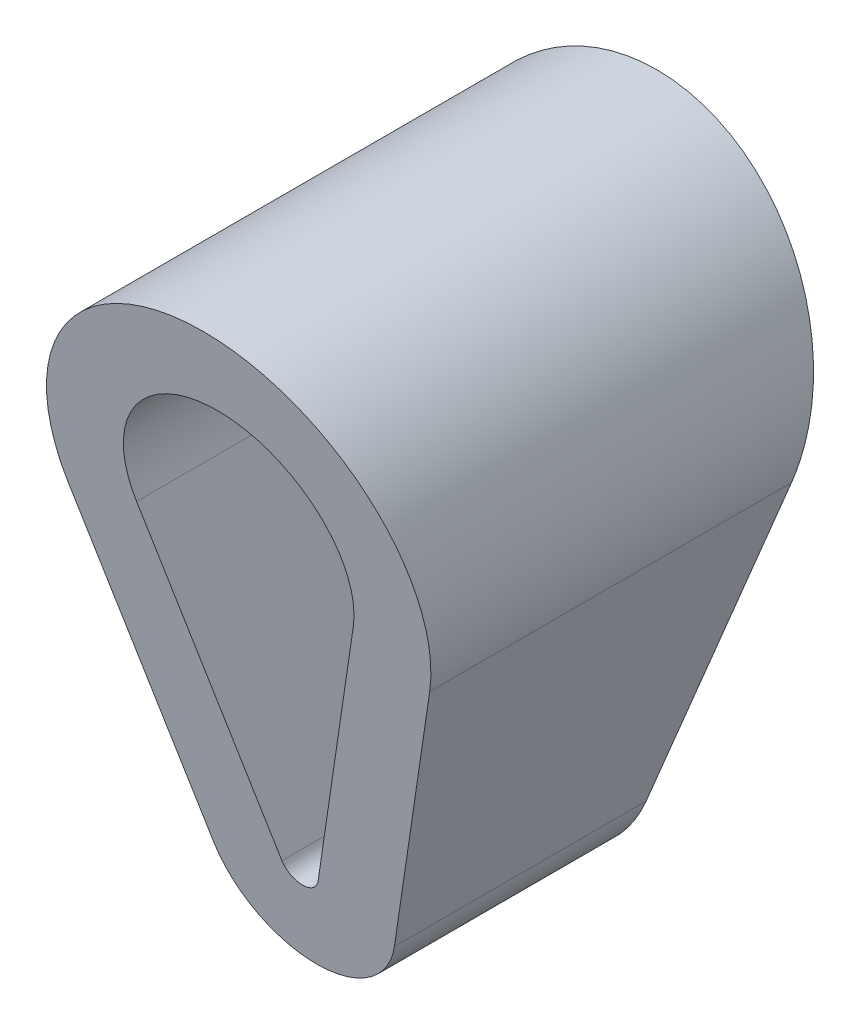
ISO-10303-21;
HEADER;
FILE_DESCRIPTION(('STEP AP214'),'2;1');
FILE_NAME('part.step','',(''),(''),'','','');
FILE_SCHEMA(('AUTOMOTIVE_DESIGN { 1 0 10303 214 1 1 1 1 }'));
ENDSEC;
DATA;
#1=APPLICATION_CONTEXT('core data for automotive mechanical design processes');
#2=APPLICATION_PROTOCOL_DEFINITION('international standard','automotive_design',2000,#1);
#3=PRODUCT_CONTEXT('',#1,'mechanical');
#4=PRODUCT('Part','Part','',(#3));
#5=PRODUCT_RELATED_PRODUCT_CATEGORY('part','',(#4));
#6=PRODUCT_DEFINITION_FORMATION('','',#4);
#7=PRODUCT_DEFINITION_CONTEXT('part definition',#1,'design');
#8=PRODUCT_DEFINITION('design','',#6,#7);
#9=PRODUCT_DEFINITION_SHAPE('','',#8);
#10=(LENGTH_UNIT() NAMED_UNIT(*) SI_UNIT(.MILLI.,.METRE.));
#11=(NAMED_UNIT(*) PLANE_ANGLE_UNIT() SI_UNIT($,.RADIAN.));
#12=(NAMED_UNIT(*) SI_UNIT($,.STERADIAN.) SOLID_ANGLE_UNIT());
#13=UNCERTAINTY_MEASURE_WITH_UNIT(LENGTH_MEASURE(1.E-05),#10,'distance_accuracy_value','');
#14=(GEOMETRIC_REPRESENTATION_CONTEXT(3) GLOBAL_UNCERTAINTY_ASSIGNED_CONTEXT((#13)) GLOBAL_UNIT_ASSIGNED_CONTEXT((#10,
#11,#12)) REPRESENTATION_CONTEXT('',''));
#15=CARTESIAN_POINT('',(0.,0.,0.));
#16=DIRECTION('',(0.,0.,1.));
#17=DIRECTION('',(1.,0.,0.));
#18=AXIS2_PLACEMENT_3D('',#15,#16,#17);
#19=CARTESIAN_POINT('',(0.,4.25,3.));
#20=DIRECTION('',(0.,0.,-1.));
#21=DIRECTION('',(-1.,0.,0.));
#22=AXIS2_PLACEMENT_3D('',#19,#20,#21);
#23=CYLINDRICAL_SURFACE('',#22,2.5);
#24=DIRECTION('',(0.,0.,-1.));
#25=VECTOR('',#24,1.);
#26=CARTESIAN_POINT('',(2.38942306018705,3.51470588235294,3.));
#27=LINE('',#26,#25);
#28=CARTESIAN_POINT('',(2.38942306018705,3.51470588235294,2.39338235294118));
#29=VERTEX_POINT('',#28);
#30=CARTESIAN_POINT('',(2.38942306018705,3.51470588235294,-2.39338235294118));
#31=VERTEX_POINT('',#30);
#32=EDGE_CURVE('E128',#29,#31,#27,.T.);
#33=ORIENTED_EDGE('',*,*,#32,.T.);
#34=CARTESIAN_POINT('',(0.,4.25,-2.53125));
#35=DIRECTION('',(0.,-0.184288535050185,-0.982872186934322));
#36=DIRECTION('',(0.,0.982872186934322,-0.184288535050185));
#37=AXIS2_PLACEMENT_3D('',#34,#35,#36);
#38=ELLIPSE('',#37,2.54356571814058,2.5);
#39=CARTESIAN_POINT('',(-2.38942306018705,3.51470588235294,-2.39338235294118));
#40=VERTEX_POINT('',#39);
#41=EDGE_CURVE('E47',#40,#31,#38,.T.);
#42=ORIENTED_EDGE('',*,*,#41,.F.);
#43=DIRECTION('',(0.,0.,-1.));
#44=VECTOR('',#43,1.);
#45=CARTESIAN_POINT('',(-2.38942306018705,3.51470588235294,3.));
#46=LINE('',#45,#44);
#47=CARTESIAN_POINT('',(-2.38942306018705,3.51470588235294,2.39338235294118));
#48=VERTEX_POINT('',#47);
#49=EDGE_CURVE('E40',#48,#40,#46,.T.);
#50=ORIENTED_EDGE('',*,*,#49,.F.);
#51=CARTESIAN_POINT('',(0.,4.25,2.53125));
#52=DIRECTION('',(0.,-0.184288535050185,0.982872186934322));
#53=DIRECTION('',(0.,-0.982872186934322,-0.184288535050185));
#54=AXIS2_PLACEMENT_3D('',#51,#52,#53);
#55=ELLIPSE('',#54,2.54356571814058,2.5);
#56=EDGE_CURVE('E117',#29,#48,#55,.T.);
#57=ORIENTED_EDGE('',*,*,#56,.F.);
#58=EDGE_LOOP('',(#33,#42,#50,#57));
#59=FACE_BOUND('',#58,.T.);
#60=ADVANCED_FACE('F33',(#59),#23,.T.);
#61=CARTESIAN_POINT('',(-2.38942306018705,3.51470588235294,3.));
#62=DIRECTION('',(0.955769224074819,0.294117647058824,0.));
#63=DIRECTION('',(-0.294117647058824,0.955769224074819,0.));
#64=AXIS2_PLACEMENT_3D('',#61,#62,#63);
#65=PLANE('',#64);
#66=DIRECTION('',(-0.289505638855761,0.940781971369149,-0.176396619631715));
#67=VECTOR('',#66,1.);
#68=CARTESIAN_POINT('',(-2.11399480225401,2.61966998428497,-2.22556312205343));
#69=LINE('',#68,#67);
#70=CARTESIAN_POINT('',(-1.19471153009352,-0.367647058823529,-1.66544117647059));
#71=VERTEX_POINT('',#70);
#72=EDGE_CURVE('E143',#71,#40,#69,.T.);
#73=ORIENTED_EDGE('',*,*,#72,.F.);
#74=DIRECTION('',(0.,0.,-1.));
#75=VECTOR('',#74,1.);
#76=CARTESIAN_POINT('',(-1.19471153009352,-0.367647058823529,3.));
#77=LINE('',#76,#75);
#78=CARTESIAN_POINT('',(-1.19471153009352,-0.367647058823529,1.66544117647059));
#79=VERTEX_POINT('',#78);
#80=EDGE_CURVE('E134',#79,#71,#77,.T.);
#81=ORIENTED_EDGE('',*,*,#80,.F.);
#82=DIRECTION('',(0.289505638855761,-0.940781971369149,-0.176396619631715));
#83=VECTOR('',#82,1.);
#84=CARTESIAN_POINT('',(-2.42040169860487,3.61537454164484,2.41225772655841));
#85=LINE('',#84,#83);
#86=EDGE_CURVE('E121',#48,#79,#85,.T.);
#87=ORIENTED_EDGE('',*,*,#86,.F.);
#88=ORIENTED_EDGE('',*,*,#49,.T.);
#89=EDGE_LOOP('',(#73,#81,#87,#88));
#90=FACE_BOUND('',#89,.T.);
#91=ADVANCED_FACE('F141',(#90),#65,.F.);
#92=CARTESIAN_POINT('',(0.,0.,3.));
#93=DIRECTION('',(0.,0.,-1.));
#94=DIRECTION('',(-1.,0.,0.));
#95=AXIS2_PLACEMENT_3D('',#92,#93,#94);
#96=CYLINDRICAL_SURFACE('',#95,1.25);
#97=ORIENTED_EDGE('',*,*,#80,.T.);
#98=CARTESIAN_POINT('',(0.,0.,-1.734375));
#99=DIRECTION('',(0.,-0.184288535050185,-0.982872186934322));
#100=DIRECTION('',(0.,0.982872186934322,-0.184288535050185));
#101=AXIS2_PLACEMENT_3D('',#98,#99,#100);
#102=ELLIPSE('',#101,1.27178285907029,1.25);
#103=CARTESIAN_POINT('',(1.19471153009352,-0.367647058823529,-1.66544117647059));
#104=VERTEX_POINT('',#103);
#105=EDGE_CURVE('E150',#104,#71,#102,.T.);
#106=ORIENTED_EDGE('',*,*,#105,.F.);
#107=DIRECTION('',(0.,0.,-1.));
#108=VECTOR('',#107,1.);
#109=CARTESIAN_POINT('',(1.19471153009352,-0.367647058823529,3.));
#110=LINE('',#109,#108);
#111=CARTESIAN_POINT('',(1.19471153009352,-0.367647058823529,1.66544117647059));
#112=VERTEX_POINT('',#111);
#113=EDGE_CURVE('E131',#112,#104,#110,.T.);
#114=ORIENTED_EDGE('',*,*,#113,.F.);
#115=CARTESIAN_POINT('',(0.,0.,1.734375));
#116=DIRECTION('',(0.,-0.184288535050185,0.982872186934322));
#117=DIRECTION('',(0.,-0.982872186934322,-0.184288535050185));
#118=AXIS2_PLACEMENT_3D('',#115,#116,#117);
#119=ELLIPSE('',#118,1.27178285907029,1.25);
#120=EDGE_CURVE('E164',#79,#112,#119,.T.);
#121=ORIENTED_EDGE('',*,*,#120,.F.);
#122=EDGE_LOOP('',(#97,#106,#114,#121));
#123=FACE_BOUND('',#122,.T.);
#124=ADVANCED_FACE('F171',(#123),#96,.T.);
#125=CARTESIAN_POINT('',(2.38942306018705,3.51470588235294,3.));
#126=DIRECTION('',(-0.955769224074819,0.294117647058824,0.));
#127=DIRECTION('',(-0.294117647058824,-0.955769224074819,0.));
#128=AXIS2_PLACEMENT_3D('',#125,#126,#127);
#129=PLANE('',#128);
#130=DIRECTION('',(-0.289505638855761,-0.940781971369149,0.176396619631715));
#131=VECTOR('',#130,1.);
#132=CARTESIAN_POINT('',(2.11399480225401,2.61966998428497,-2.22556312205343));
#133=LINE('',#132,#131);
#134=EDGE_CURVE('E112',#31,#104,#133,.T.);
#135=ORIENTED_EDGE('',*,*,#134,.F.);
#136=ORIENTED_EDGE('',*,*,#32,.F.);
#137=DIRECTION('',(0.289505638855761,0.940781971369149,0.176396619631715));
#138=VECTOR('',#137,1.);
#139=CARTESIAN_POINT('',(2.42040169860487,3.61537454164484,2.41225772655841));
#140=LINE('',#139,#138);
#141=EDGE_CURVE('E162',#112,#29,#140,.T.);
#142=ORIENTED_EDGE('',*,*,#141,.F.);
#143=ORIENTED_EDGE('',*,*,#113,.T.);
#144=EDGE_LOOP('',(#135,#136,#142,#143));
#145=FACE_BOUND('',#144,.T.);
#146=ADVANCED_FACE('F173',(#145),#129,.F.);
#147=CARTESIAN_POINT('',(0.,4.25,3.));
#148=DIRECTION('',(0.,0.,-1.));
#149=DIRECTION('',(-1.,0.,0.));
#150=AXIS2_PLACEMENT_3D('',#147,#148,#149);
#151=CYLINDRICAL_SURFACE('',#150,1.5);
#152=DIRECTION('',(0.,0.,-1.));
#153=VECTOR('',#152,1.);
#154=CARTESIAN_POINT('',(-1.43365383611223,3.80882352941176,3.));
#155=LINE('',#154,#153);
#156=CARTESIAN_POINT('',(-1.43365383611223,3.80882352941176,2.44852941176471));
#157=VERTEX_POINT('',#156);
#158=CARTESIAN_POINT('',(-1.43365383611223,3.80882352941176,-2.44852941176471));
#159=VERTEX_POINT('',#158);
#160=EDGE_CURVE('E111',#157,#159,#155,.T.);
#161=ORIENTED_EDGE('',*,*,#160,.T.);
#162=CARTESIAN_POINT('',(0.,4.25,-2.53125));
#163=DIRECTION('',(0.,-0.184288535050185,-0.982872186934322));
#164=DIRECTION('',(0.,0.982872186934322,-0.184288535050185));
#165=AXIS2_PLACEMENT_3D('',#162,#163,#164);
#166=ELLIPSE('',#165,1.52613943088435,1.5);
#167=CARTESIAN_POINT('',(1.43365383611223,3.80882352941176,-2.44852941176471));
#168=VERTEX_POINT('',#167);
#169=EDGE_CURVE('E97',#159,#168,#166,.T.);
#170=ORIENTED_EDGE('',*,*,#169,.T.);
#171=DIRECTION('',(0.,0.,-1.));
#172=VECTOR('',#171,1.);
#173=CARTESIAN_POINT('',(1.43365383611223,3.80882352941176,3.));
#174=LINE('',#173,#172);
#175=CARTESIAN_POINT('',(1.43365383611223,3.80882352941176,2.44852941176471));
#176=VERTEX_POINT('',#175);
#177=EDGE_CURVE('E109',#176,#168,#174,.T.);
#178=ORIENTED_EDGE('',*,*,#177,.F.);
#179=CARTESIAN_POINT('',(0.,4.25,2.53125));
#180=DIRECTION('',(0.,-0.184288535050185,0.982872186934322));
#181=DIRECTION('',(0.,-0.982872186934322,-0.184288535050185));
#182=AXIS2_PLACEMENT_3D('',#179,#180,#181);
#183=ELLIPSE('',#182,1.52613943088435,1.5);
#184=EDGE_CURVE('E160',#176,#157,#183,.T.);
#185=ORIENTED_EDGE('',*,*,#184,.T.);
#186=EDGE_LOOP('',(#161,#170,#178,#185));
#187=FACE_BOUND('',#186,.T.);
#188=ADVANCED_FACE('F107',(#187),#151,.F.);
#189=CARTESIAN_POINT('',(-1.43365383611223,3.80882352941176,3.));
#190=DIRECTION('',(0.955769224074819,0.294117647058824,0.));
#191=DIRECTION('',(-0.294117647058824,0.955769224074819,0.));
#192=AXIS2_PLACEMENT_3D('',#189,#190,#191);
#193=PLANE('',#192);
#194=DIRECTION('',(0.,0.,-1.));
#195=VECTOR('',#194,1.);
#196=CARTESIAN_POINT('',(-0.238942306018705,-0.0735294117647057,3.));
#197=LINE('',#196,#195);
#198=CARTESIAN_POINT('',(-0.238942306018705,-0.0735294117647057,1.72058823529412));
#199=VERTEX_POINT('',#198);
#200=CARTESIAN_POINT('',(-0.238942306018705,-0.0735294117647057,-1.72058823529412));
#201=VERTEX_POINT('',#200);
#202=EDGE_CURVE('E119',#199,#201,#197,.T.);
#203=ORIENTED_EDGE('',*,*,#202,.T.);
#204=DIRECTION('',(-0.289505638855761,0.940781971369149,-0.176396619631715));
#205=VECTOR('',#204,1.);
#206=CARTESIAN_POINT('',(-1.15540933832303,2.90463593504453,-2.27899423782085));
#207=LINE('',#206,#205);
#208=EDGE_CURVE('E113',#201,#159,#207,.T.);
#209=ORIENTED_EDGE('',*,*,#208,.T.);
#210=ORIENTED_EDGE('',*,*,#160,.F.);
#211=DIRECTION('',(0.289505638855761,-0.940781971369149,-0.176396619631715));
#212=VECTOR('',#211,1.);
#213=CARTESIAN_POINT('',(-1.46181623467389,3.9003404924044,2.46568884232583));
#214=LINE('',#213,#212);
#215=EDGE_CURVE('E157',#157,#199,#214,.T.);
#216=ORIENTED_EDGE('',*,*,#215,.T.);
#217=EDGE_LOOP('',(#203,#209,#210,#216));
#218=FACE_BOUND('',#217,.T.);
#219=ADVANCED_FACE('F180',(#218),#193,.T.);
#220=CARTESIAN_POINT('',(0.,0.,3.));
#221=DIRECTION('',(0.,0.,-1.));
#222=DIRECTION('',(-1.,0.,0.));
#223=AXIS2_PLACEMENT_3D('',#220,#221,#222);
#224=CYLINDRICAL_SURFACE('',#223,0.25);
#225=DIRECTION('',(0.,0.,-1.));
#226=VECTOR('',#225,1.);
#227=CARTESIAN_POINT('',(0.238942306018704,-0.0735294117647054,3.));
#228=LINE('',#227,#226);
#229=CARTESIAN_POINT('',(0.238942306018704,-0.0735294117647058,1.72058823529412));
#230=VERTEX_POINT('',#229);
#231=CARTESIAN_POINT('',(0.238942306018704,-0.0735294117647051,-1.72058823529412));
#232=VERTEX_POINT('',#231);
#233=EDGE_CURVE('E116',#230,#232,#228,.T.);
#234=ORIENTED_EDGE('',*,*,#233,.T.);
#235=CARTESIAN_POINT('',(0.,0.,-1.734375));
#236=DIRECTION('',(0.,-0.184288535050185,-0.982872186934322));
#237=DIRECTION('',(0.,0.982872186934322,-0.184288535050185));
#238=AXIS2_PLACEMENT_3D('',#235,#236,#237);
#239=ELLIPSE('',#238,0.254356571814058,0.25);
#240=EDGE_CURVE('E55',#232,#201,#239,.T.);
#241=ORIENTED_EDGE('',*,*,#240,.T.);
#242=ORIENTED_EDGE('',*,*,#202,.F.);
#243=CARTESIAN_POINT('',(0.,0.,1.734375));
#244=DIRECTION('',(0.,-0.184288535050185,0.982872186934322));
#245=DIRECTION('',(0.,-0.982872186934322,-0.184288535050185));
#246=AXIS2_PLACEMENT_3D('',#243,#244,#245);
#247=ELLIPSE('',#246,0.254356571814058,0.25);
#248=EDGE_CURVE('E147',#199,#230,#247,.T.);
#249=ORIENTED_EDGE('',*,*,#248,.T.);
#250=EDGE_LOOP('',(#234,#241,#242,#249));
#251=FACE_BOUND('',#250,.T.);
#252=ADVANCED_FACE('F178',(#251),#224,.F.);
#253=CARTESIAN_POINT('',(1.43365383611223,3.80882352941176,3.));
#254=DIRECTION('',(-0.955769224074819,0.294117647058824,0.));
#255=DIRECTION('',(-0.294117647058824,-0.955769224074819,0.));
#256=AXIS2_PLACEMENT_3D('',#253,#254,#255);
#257=PLANE('',#256);
#258=ORIENTED_EDGE('',*,*,#177,.T.);
#259=DIRECTION('',(-0.289505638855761,-0.940781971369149,0.176396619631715));
#260=VECTOR('',#259,1.);
#261=CARTESIAN_POINT('',(1.15540933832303,2.90463593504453,-2.27899423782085));
#262=LINE('',#261,#260);
#263=EDGE_CURVE('E94',#168,#232,#262,.T.);
#264=ORIENTED_EDGE('',*,*,#263,.T.);
#265=ORIENTED_EDGE('',*,*,#233,.F.);
#266=DIRECTION('',(0.289505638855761,0.940781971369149,0.176396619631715));
#267=VECTOR('',#266,1.);
#268=CARTESIAN_POINT('',(1.46181623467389,3.9003404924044,2.46568884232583));
#269=LINE('',#268,#267);
#270=EDGE_CURVE('E11',#230,#176,#269,.T.);
#271=ORIENTED_EDGE('',*,*,#270,.T.);
#272=EDGE_LOOP('',(#258,#264,#265,#271));
#273=FACE_BOUND('',#272,.T.);
#274=ADVANCED_FACE('F115',(#273),#257,.T.);
#275=CARTESIAN_POINT('',(2.5,6.75,3.));
#276=DIRECTION('',(0.,-0.184288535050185,0.982872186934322));
#277=DIRECTION('',(0.,-0.982872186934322,-0.184288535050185));
#278=AXIS2_PLACEMENT_3D('',#275,#276,#277);
#279=PLANE('',#278);
#280=ORIENTED_EDGE('',*,*,#270,.F.);
#281=ORIENTED_EDGE('',*,*,#248,.F.);
#282=ORIENTED_EDGE('',*,*,#215,.F.);
#283=ORIENTED_EDGE('',*,*,#184,.F.);
#284=EDGE_LOOP('',(#280,#281,#282,#283));
#285=FACE_BOUND('',#284,.T.);
#286=ORIENTED_EDGE('',*,*,#56,.T.);
#287=ORIENTED_EDGE('',*,*,#86,.T.);
#288=ORIENTED_EDGE('',*,*,#120,.T.);
#289=ORIENTED_EDGE('',*,*,#141,.T.);
#290=EDGE_LOOP('',(#286,#287,#288,#289));
#291=FACE_BOUND('',#290,.T.);
#292=ADVANCED_FACE('F168',(#285,#291),#279,.T.);
#293=CARTESIAN_POINT('',(2.5,-1.25,-1.5));
#294=DIRECTION('',(0.,-0.184288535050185,-0.982872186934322));
#295=DIRECTION('',(0.,0.982872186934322,-0.184288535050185));
#296=AXIS2_PLACEMENT_3D('',#293,#294,#295);
#297=PLANE('',#296);
#298=ORIENTED_EDGE('',*,*,#208,.F.);
#299=ORIENTED_EDGE('',*,*,#240,.F.);
#300=ORIENTED_EDGE('',*,*,#263,.F.);
#301=ORIENTED_EDGE('',*,*,#169,.F.);
#302=EDGE_LOOP('',(#298,#299,#300,#301));
#303=FACE_BOUND('',#302,.T.);
#304=ORIENTED_EDGE('',*,*,#41,.T.);
#305=ORIENTED_EDGE('',*,*,#134,.T.);
#306=ORIENTED_EDGE('',*,*,#105,.T.);
#307=ORIENTED_EDGE('',*,*,#72,.T.);
#308=EDGE_LOOP('',(#304,#305,#306,#307));
#309=FACE_BOUND('',#308,.T.);
#310=ADVANCED_FACE('F96',(#303,#309),#297,.T.);
#311=CLOSED_SHELL('',(#60,#91,#124,#146,#188,#219,#252,#274,#292,#310));
#312=MANIFOLD_SOLID_BREP('B2',#311);
#313=ADVANCED_BREP_SHAPE_REPRESENTATION('',(#18,#312),#14);
#314=SHAPE_DEFINITION_REPRESENTATION(#9,#313);
ENDSEC;
END-ISO-10303-21;
